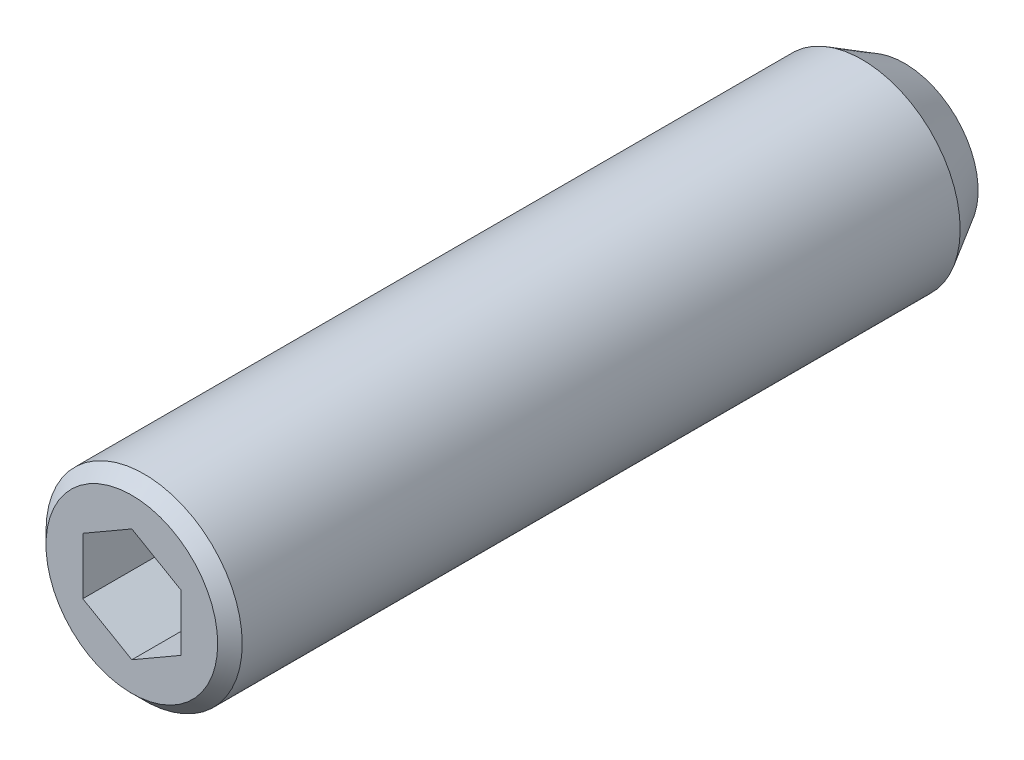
ISO-10303-21;
HEADER;
FILE_DESCRIPTION(('STEP AP214'),'2;1');
FILE_NAME('part.step','',(''),(''),'','','');
FILE_SCHEMA(('AUTOMOTIVE_DESIGN { 1 0 10303 214 1 1 1 1 }'));
ENDSEC;
DATA;
#1=APPLICATION_CONTEXT('core data for automotive mechanical design processes');
#2=APPLICATION_PROTOCOL_DEFINITION('international standard','automotive_design',2000,#1);
#3=PRODUCT_CONTEXT('',#1,'mechanical');
#4=PRODUCT('Part','Part','',(#3));
#5=PRODUCT_RELATED_PRODUCT_CATEGORY('part','',(#4));
#6=PRODUCT_DEFINITION_FORMATION('','',#4);
#7=PRODUCT_DEFINITION_CONTEXT('part definition',#1,'design');
#8=PRODUCT_DEFINITION('design','',#6,#7);
#9=PRODUCT_DEFINITION_SHAPE('','',#8);
#10=(LENGTH_UNIT() NAMED_UNIT(*) SI_UNIT(.MILLI.,.METRE.));
#11=(NAMED_UNIT(*) PLANE_ANGLE_UNIT() SI_UNIT($,.RADIAN.));
#12=(NAMED_UNIT(*) SI_UNIT($,.STERADIAN.) SOLID_ANGLE_UNIT());
#13=UNCERTAINTY_MEASURE_WITH_UNIT(LENGTH_MEASURE(1.E-05),#10,'distance_accuracy_value','');
#14=(GEOMETRIC_REPRESENTATION_CONTEXT(3) GLOBAL_UNCERTAINTY_ASSIGNED_CONTEXT((#13)) GLOBAL_UNIT_ASSIGNED_CONTEXT((#10,
#11,#12)) REPRESENTATION_CONTEXT('',''));
#15=CARTESIAN_POINT('',(0.,0.,0.));
#16=DIRECTION('',(0.,0.,1.));
#17=DIRECTION('',(1.,0.,0.));
#18=AXIS2_PLACEMENT_3D('',#15,#16,#17);
#19=CARTESIAN_POINT('',(1.,0.577350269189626,14.5));
#20=DIRECTION('',(0.5,0.866025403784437,0.));
#21=DIRECTION('',(0.866025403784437,-0.5,0.));
#22=AXIS2_PLACEMENT_3D('',#19,#20,#21);
#23=PLANE('',#22);
#24=DIRECTION('',(0.,0.,1.));
#25=VECTOR('',#24,1.);
#26=CARTESIAN_POINT('',(1.,0.577350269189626,14.5));
#27=LINE('',#26,#25);
#28=CARTESIAN_POINT('',(1.,0.577350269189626,14.5));
#29=VERTEX_POINT('',#28);
#30=CARTESIAN_POINT('',(1.,0.577350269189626,16.5));
#31=VERTEX_POINT('',#30);
#32=EDGE_CURVE('E96',#29,#31,#27,.T.);
#33=ORIENTED_EDGE('',*,*,#32,.T.);
#34=DIRECTION('',(-0.866025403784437,0.5,0.));
#35=VECTOR('',#34,1.);
#36=CARTESIAN_POINT('',(1.,0.577350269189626,16.5));
#37=LINE('',#36,#35);
#38=CARTESIAN_POINT('',(0.,1.15470053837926,16.5));
#39=VERTEX_POINT('',#38);
#40=EDGE_CURVE('E29',#31,#39,#37,.T.);
#41=ORIENTED_EDGE('',*,*,#40,.T.);
#42=DIRECTION('',(0.,0.,1.));
#43=VECTOR('',#42,1.);
#44=CARTESIAN_POINT('',(0.,1.15470053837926,14.5));
#45=LINE('',#44,#43);
#46=CARTESIAN_POINT('',(0.,1.15470053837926,14.5));
#47=VERTEX_POINT('',#46);
#48=EDGE_CURVE('E34',#47,#39,#45,.T.);
#49=ORIENTED_EDGE('',*,*,#48,.F.);
#50=DIRECTION('',(-0.866025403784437,0.5,0.));
#51=VECTOR('',#50,1.);
#52=CARTESIAN_POINT('',(1.,0.577350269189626,14.5));
#53=LINE('',#52,#51);
#54=EDGE_CURVE('E90',#29,#47,#53,.T.);
#55=ORIENTED_EDGE('',*,*,#54,.F.);
#56=EDGE_LOOP('',(#33,#41,#49,#55));
#57=FACE_BOUND('',#56,.T.);
#58=ADVANCED_FACE('F14',(#57),#23,.F.);
#59=CARTESIAN_POINT('',(1.,-0.577350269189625,14.5));
#60=DIRECTION('',(1.,0.,0.));
#61=DIRECTION('',(0.,-1.,0.));
#62=AXIS2_PLACEMENT_3D('',#59,#60,#61);
#63=PLANE('',#62);
#64=DIRECTION('',(0.,0.,1.));
#65=VECTOR('',#64,1.);
#66=CARTESIAN_POINT('',(1.,-0.577350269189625,14.5));
#67=LINE('',#66,#65);
#68=CARTESIAN_POINT('',(1.,-0.577350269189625,14.5));
#69=VERTEX_POINT('',#68);
#70=CARTESIAN_POINT('',(1.,-0.577350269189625,16.5));
#71=VERTEX_POINT('',#70);
#72=EDGE_CURVE('E93',#69,#71,#67,.T.);
#73=ORIENTED_EDGE('',*,*,#72,.T.);
#74=DIRECTION('',(0.,1.,0.));
#75=VECTOR('',#74,1.);
#76=CARTESIAN_POINT('',(1.,-0.577350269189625,16.5));
#77=LINE('',#76,#75);
#78=EDGE_CURVE('E156',#71,#31,#77,.T.);
#79=ORIENTED_EDGE('',*,*,#78,.T.);
#80=ORIENTED_EDGE('',*,*,#32,.F.);
#81=DIRECTION('',(0.,1.,0.));
#82=VECTOR('',#81,1.);
#83=CARTESIAN_POINT('',(1.,-0.577350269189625,14.5));
#84=LINE('',#83,#82);
#85=EDGE_CURVE('E85',#69,#29,#84,.T.);
#86=ORIENTED_EDGE('',*,*,#85,.F.);
#87=EDGE_LOOP('',(#73,#79,#80,#86));
#88=FACE_BOUND('',#87,.T.);
#89=ADVANCED_FACE('F122',(#88),#63,.F.);
#90=CARTESIAN_POINT('',(1.,-0.577350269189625,14.5));
#91=DIRECTION('',(-0.5,0.866025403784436,0.));
#92=DIRECTION('',(0.866025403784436,0.5,0.));
#93=AXIS2_PLACEMENT_3D('',#90,#91,#92);
#94=PLANE('',#93);
#95=DIRECTION('',(0.,0.,1.));
#96=VECTOR('',#95,1.);
#97=CARTESIAN_POINT('',(0.,-1.15470053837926,14.5));
#98=LINE('',#97,#96);
#99=CARTESIAN_POINT('',(0.,-1.15470053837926,14.5));
#100=VERTEX_POINT('',#99);
#101=CARTESIAN_POINT('',(0.,-1.15470053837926,16.5));
#102=VERTEX_POINT('',#101);
#103=EDGE_CURVE('E68',#100,#102,#98,.T.);
#104=ORIENTED_EDGE('',*,*,#103,.T.);
#105=DIRECTION('',(-0.866025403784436,-0.5,0.));
#106=VECTOR('',#105,1.);
#107=CARTESIAN_POINT('',(1.,-0.577350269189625,16.5));
#108=LINE('',#107,#106);
#109=EDGE_CURVE('E148',#71,#102,#108,.T.);
#110=ORIENTED_EDGE('',*,*,#109,.F.);
#111=ORIENTED_EDGE('',*,*,#72,.F.);
#112=DIRECTION('',(-0.866025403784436,-0.5,0.));
#113=VECTOR('',#112,1.);
#114=CARTESIAN_POINT('',(1.,-0.577350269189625,14.5));
#115=LINE('',#114,#113);
#116=EDGE_CURVE('E83',#69,#100,#115,.T.);
#117=ORIENTED_EDGE('',*,*,#116,.T.);
#118=EDGE_LOOP('',(#104,#110,#111,#117));
#119=FACE_BOUND('',#118,.T.);
#120=ADVANCED_FACE('F127',(#119),#94,.T.);
#121=CARTESIAN_POINT('',(-1.,-0.577350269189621,14.5));
#122=DIRECTION('',(-0.5,-0.866025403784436,0.));
#123=DIRECTION('',(-0.866025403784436,0.5,0.));
#124=AXIS2_PLACEMENT_3D('',#121,#122,#123);
#125=PLANE('',#124);
#126=DIRECTION('',(0.,0.,1.));
#127=VECTOR('',#126,1.);
#128=CARTESIAN_POINT('',(-1.,-0.577350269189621,14.5));
#129=LINE('',#128,#127);
#130=CARTESIAN_POINT('',(-1.,-0.577350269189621,14.5));
#131=VERTEX_POINT('',#130);
#132=CARTESIAN_POINT('',(-1.,-0.577350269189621,16.5));
#133=VERTEX_POINT('',#132);
#134=EDGE_CURVE('E56',#131,#133,#129,.T.);
#135=ORIENTED_EDGE('',*,*,#134,.T.);
#136=DIRECTION('',(0.866025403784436,-0.5,0.));
#137=VECTOR('',#136,1.);
#138=CARTESIAN_POINT('',(-1.,-0.577350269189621,16.5));
#139=LINE('',#138,#137);
#140=EDGE_CURVE('E151',#133,#102,#139,.T.);
#141=ORIENTED_EDGE('',*,*,#140,.T.);
#142=ORIENTED_EDGE('',*,*,#103,.F.);
#143=DIRECTION('',(0.866025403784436,-0.5,0.));
#144=VECTOR('',#143,1.);
#145=CARTESIAN_POINT('',(-1.,-0.577350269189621,14.5));
#146=LINE('',#145,#144);
#147=EDGE_CURVE('E76',#131,#100,#146,.T.);
#148=ORIENTED_EDGE('',*,*,#147,.F.);
#149=EDGE_LOOP('',(#135,#141,#142,#148));
#150=FACE_BOUND('',#149,.T.);
#151=ADVANCED_FACE('F81',(#150),#125,.F.);
#152=CARTESIAN_POINT('',(-1.,-0.577350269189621,14.5));
#153=DIRECTION('',(1.,0.,0.));
#154=DIRECTION('',(0.,-1.,0.));
#155=AXIS2_PLACEMENT_3D('',#152,#153,#154);
#156=PLANE('',#155);
#157=DIRECTION('',(0.,0.,1.));
#158=VECTOR('',#157,1.);
#159=CARTESIAN_POINT('',(-1.,0.577350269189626,14.5));
#160=LINE('',#159,#158);
#161=CARTESIAN_POINT('',(-1.,0.577350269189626,14.5));
#162=VERTEX_POINT('',#161);
#163=CARTESIAN_POINT('',(-1.,0.577350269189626,16.5));
#164=VERTEX_POINT('',#163);
#165=EDGE_CURVE('E69',#162,#164,#160,.T.);
#166=ORIENTED_EDGE('',*,*,#165,.T.);
#167=DIRECTION('',(0.,1.,0.));
#168=VECTOR('',#167,1.);
#169=CARTESIAN_POINT('',(-1.,-0.577350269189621,16.5));
#170=LINE('',#169,#168);
#171=EDGE_CURVE('E63',#133,#164,#170,.T.);
#172=ORIENTED_EDGE('',*,*,#171,.F.);
#173=ORIENTED_EDGE('',*,*,#134,.F.);
#174=DIRECTION('',(0.,1.,0.));
#175=VECTOR('',#174,1.);
#176=CARTESIAN_POINT('',(-1.,-0.577350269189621,14.5));
#177=LINE('',#176,#175);
#178=EDGE_CURVE('E60',#131,#162,#177,.T.);
#179=ORIENTED_EDGE('',*,*,#178,.T.);
#180=EDGE_LOOP('',(#166,#172,#173,#179));
#181=FACE_BOUND('',#180,.T.);
#182=ADVANCED_FACE('F59',(#181),#156,.T.);
#183=CARTESIAN_POINT('',(-1.,0.577350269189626,14.5));
#184=DIRECTION('',(0.5,-0.866025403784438,0.));
#185=DIRECTION('',(-0.866025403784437,-0.5,0.));
#186=AXIS2_PLACEMENT_3D('',#183,#184,#185);
#187=PLANE('',#186);
#188=DIRECTION('',(0.866025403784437,0.5,0.));
#189=VECTOR('',#188,1.);
#190=CARTESIAN_POINT('',(-1.,0.577350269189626,14.5));
#191=LINE('',#190,#189);
#192=EDGE_CURVE('E79',#162,#47,#191,.T.);
#193=ORIENTED_EDGE('',*,*,#192,.T.);
#194=ORIENTED_EDGE('',*,*,#48,.T.);
#195=DIRECTION('',(0.866025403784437,0.5,0.));
#196=VECTOR('',#195,1.);
#197=CARTESIAN_POINT('',(-1.,0.577350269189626,16.5));
#198=LINE('',#197,#196);
#199=EDGE_CURVE('E163',#164,#39,#198,.T.);
#200=ORIENTED_EDGE('',*,*,#199,.F.);
#201=ORIENTED_EDGE('',*,*,#165,.F.);
#202=EDGE_LOOP('',(#193,#194,#200,#201));
#203=FACE_BOUND('',#202,.T.);
#204=ADVANCED_FACE('F120',(#203),#187,.T.);
#205=CARTESIAN_POINT('',(2.,0.,14.5));
#206=DIRECTION('',(0.,0.,1.));
#207=DIRECTION('',(-1.,0.,0.));
#208=AXIS2_PLACEMENT_3D('',#205,#206,#207);
#209=PLANE('',#208);
#210=ORIENTED_EDGE('',*,*,#54,.T.);
#211=ORIENTED_EDGE('',*,*,#192,.F.);
#212=ORIENTED_EDGE('',*,*,#178,.F.);
#213=ORIENTED_EDGE('',*,*,#147,.T.);
#214=ORIENTED_EDGE('',*,*,#116,.F.);
#215=ORIENTED_EDGE('',*,*,#85,.T.);
#216=EDGE_LOOP('',(#210,#211,#212,#213,#214,#215));
#217=FACE_BOUND('',#216,.T.);
#218=ADVANCED_FACE('F74',(#217),#209,.T.);
#219=CARTESIAN_POINT('',(0.,0.,16.25));
#220=DIRECTION('',(0.,0.,-1.));
#221=DIRECTION('',(1.,0.,0.));
#222=AXIS2_PLACEMENT_3D('',#219,#220,#221);
#223=CYLINDRICAL_SURFACE('',#222,2.);
#224=CARTESIAN_POINT('',(0.,0.,16.25));
#225=DIRECTION('',(0.,0.,-1.));
#226=DIRECTION('',(1.,0.,0.));
#227=AXIS2_PLACEMENT_3D('',#224,#225,#226);
#228=CIRCLE('',#227,2.);
#229=CARTESIAN_POINT('',(2.,0.,16.25));
#230=VERTEX_POINT('',#229);
#231=EDGE_CURVE('E22',#230,#230,#228,.T.);
#232=ORIENTED_EDGE('',*,*,#231,.T.);
#233=EDGE_LOOP('',(#232));
#234=FACE_BOUND('',#233,.T.);
#235=CARTESIAN_POINT('',(0.,0.,1.61602540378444));
#236=DIRECTION('',(0.,0.,-1.));
#237=DIRECTION('',(-1.,0.,0.));
#238=AXIS2_PLACEMENT_3D('',#235,#236,#237);
#239=CIRCLE('',#238,2.);
#240=CARTESIAN_POINT('',(-2.,0.,1.61602540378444));
#241=VERTEX_POINT('',#240);
#242=EDGE_CURVE('E158',#241,#241,#239,.T.);
#243=ORIENTED_EDGE('',*,*,#242,.F.);
#244=EDGE_LOOP('',(#243));
#245=FACE_BOUND('',#244,.T.);
#246=ADVANCED_FACE('F103',(#234,#245),#223,.T.);
#247=CARTESIAN_POINT('',(0.,0.,16.25));
#248=DIRECTION('',(0.,0.,-1.));
#249=DIRECTION('',(1.,0.,0.));
#250=AXIS2_PLACEMENT_3D('',#247,#248,#249);
#251=CONICAL_SURFACE('',#250,2.,0.785398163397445);
#252=CARTESIAN_POINT('',(0.,0.,16.5));
#253=DIRECTION('',(0.,0.,-1.));
#254=DIRECTION('',(1.,0.,0.));
#255=AXIS2_PLACEMENT_3D('',#252,#253,#254);
#256=CIRCLE('',#255,1.75);
#257=CARTESIAN_POINT('',(1.75,0.,16.5));
#258=VERTEX_POINT('',#257);
#259=EDGE_CURVE('E98',#258,#258,#256,.T.);
#260=ORIENTED_EDGE('',*,*,#259,.T.);
#261=EDGE_LOOP('',(#260));
#262=FACE_BOUND('',#261,.T.);
#263=ORIENTED_EDGE('',*,*,#231,.F.);
#264=EDGE_LOOP('',(#263));
#265=FACE_BOUND('',#264,.T.);
#266=ADVANCED_FACE('F106',(#262,#265),#251,.T.);
#267=CARTESIAN_POINT('',(0.,0.,16.5));
#268=DIRECTION('',(0.,0.,-1.));
#269=DIRECTION('',(1.,0.,0.));
#270=AXIS2_PLACEMENT_3D('',#267,#268,#269);
#271=PLANE('',#270);
#272=ORIENTED_EDGE('',*,*,#199,.T.);
#273=ORIENTED_EDGE('',*,*,#40,.F.);
#274=ORIENTED_EDGE('',*,*,#78,.F.);
#275=ORIENTED_EDGE('',*,*,#109,.T.);
#276=ORIENTED_EDGE('',*,*,#140,.F.);
#277=ORIENTED_EDGE('',*,*,#171,.T.);
#278=EDGE_LOOP('',(#272,#273,#274,#275,#276,#277));
#279=FACE_BOUND('',#278,.T.);
#280=ORIENTED_EDGE('',*,*,#259,.F.);
#281=EDGE_LOOP('',(#280));
#282=FACE_BOUND('',#281,.T.);
#283=ADVANCED_FACE('F108',(#279,#282),#271,.F.);
#284=CARTESIAN_POINT('',(0.,0.,0.75));
#285=DIRECTION('',(0.,0.,1.));
#286=DIRECTION('',(1.,0.,0.));
#287=AXIS2_PLACEMENT_3D('',#284,#285,#286);
#288=CONICAL_SURFACE('',#287,1.5,0.523598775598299);
#289=ORIENTED_EDGE('',*,*,#242,.T.);
#290=EDGE_LOOP('',(#289));
#291=FACE_BOUND('',#290,.T.);
#292=CARTESIAN_POINT('',(0.,0.,0.75));
#293=DIRECTION('',(0.,0.,-1.));
#294=DIRECTION('',(-1.,0.,0.));
#295=AXIS2_PLACEMENT_3D('',#292,#293,#294);
#296=CIRCLE('',#295,1.5);
#297=CARTESIAN_POINT('',(-1.5,0.,0.75));
#298=VERTEX_POINT('',#297);
#299=EDGE_CURVE('E175',#298,#298,#296,.T.);
#300=ORIENTED_EDGE('',*,*,#299,.F.);
#301=EDGE_LOOP('',(#300));
#302=FACE_BOUND('',#301,.T.);
#303=ADVANCED_FACE('F116',(#291,#302),#288,.T.);
#304=CARTESIAN_POINT('',(0.,0.,1.25));
#305=DIRECTION('',(0.,0.,-1.));
#306=DIRECTION('',(1.,0.,0.));
#307=AXIS2_PLACEMENT_3D('',#304,#305,#306);
#308=SPHERICAL_SURFACE('',#307,1.25);
#309=CARTESIAN_POINT('',(0.,0.,0.75));
#310=DIRECTION('',(0.,0.,-1.));
#311=DIRECTION('',(1.,0.,0.));
#312=AXIS2_PLACEMENT_3D('',#309,#310,#311);
#313=CIRCLE('',#312,1.14564392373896);
#314=CARTESIAN_POINT('',(1.14564392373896,0.,0.75));
#315=VERTEX_POINT('',#314);
#316=EDGE_CURVE('E9',#315,#315,#313,.T.);
#317=ORIENTED_EDGE('',*,*,#316,.T.);
#318=EDGE_LOOP('',(#317));
#319=FACE_BOUND('',#318,.T.);
#320=ADVANCED_FACE('F16',(#319),#308,.T.);
#321=CARTESIAN_POINT('',(1.42264973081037,0.,0.75));
#322=DIRECTION('',(0.,0.,1.));
#323=DIRECTION('',(-1.,0.,0.));
#324=AXIS2_PLACEMENT_3D('',#321,#322,#323);
#325=PLANE('',#324);
#326=ORIENTED_EDGE('',*,*,#316,.F.);
#327=EDGE_LOOP('',(#326));
#328=FACE_BOUND('',#327,.T.);
#329=ORIENTED_EDGE('',*,*,#299,.T.);
#330=EDGE_LOOP('',(#329));
#331=FACE_BOUND('',#330,.T.);
#332=ADVANCED_FACE('F179',(#328,#331),#325,.F.);
#333=CLOSED_SHELL('',(#58,#89,#120,#151,#182,#204,#218,#246,#266,#283,#303,#320,#332));
#334=MANIFOLD_SOLID_BREP('B1',#333);
#335=ADVANCED_BREP_SHAPE_REPRESENTATION('',(#18,#334),#14);
#336=SHAPE_DEFINITION_REPRESENTATION(#9,#335);
ENDSEC;
END-ISO-10303-21;
